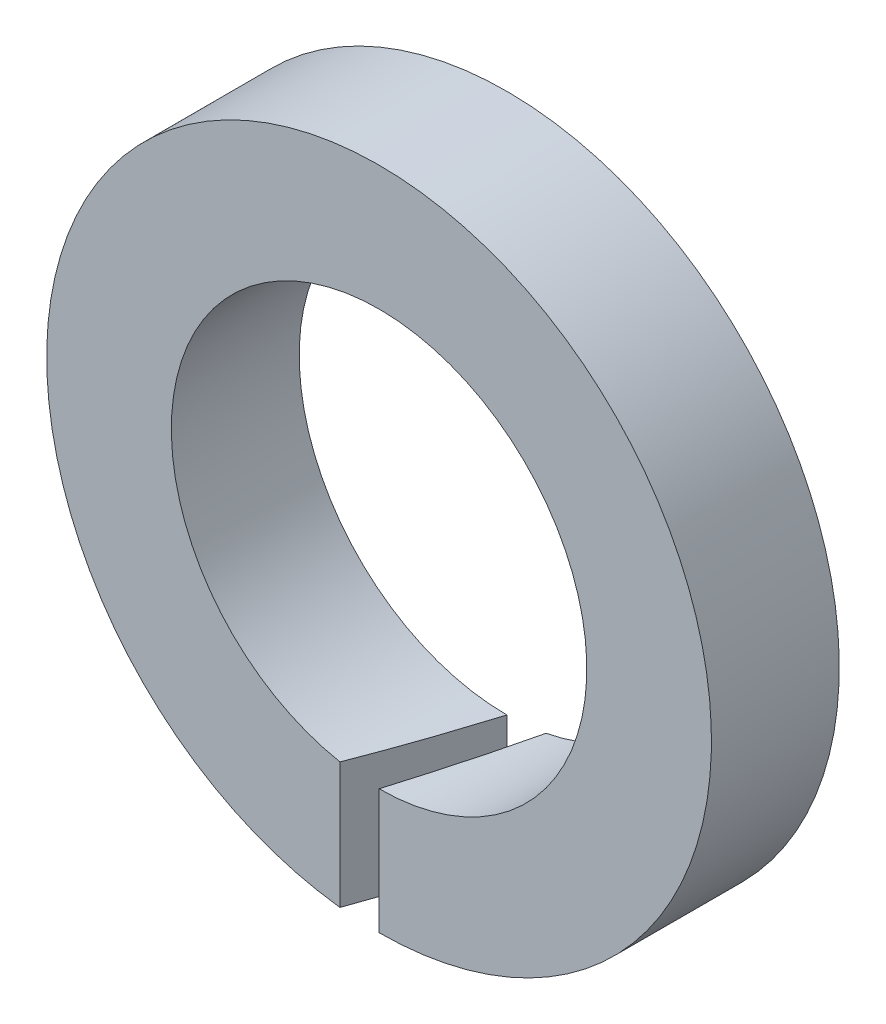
ISO-10303-21;
HEADER;
FILE_DESCRIPTION(('STEP AP214'),'2;1');
FILE_NAME('part.step','',(''),(''),'','','');
FILE_SCHEMA(('AUTOMOTIVE_DESIGN { 1 0 10303 214 1 1 1 1 }'));
ENDSEC;
DATA;
#1=APPLICATION_CONTEXT('core data for automotive mechanical design processes');
#2=APPLICATION_PROTOCOL_DEFINITION('international standard','automotive_design',2000,#1);
#3=PRODUCT_CONTEXT('',#1,'mechanical');
#4=PRODUCT('Part','Part','',(#3));
#5=PRODUCT_RELATED_PRODUCT_CATEGORY('part','',(#4));
#6=PRODUCT_DEFINITION_FORMATION('','',#4);
#7=PRODUCT_DEFINITION_CONTEXT('part definition',#1,'design');
#8=PRODUCT_DEFINITION('design','',#6,#7);
#9=PRODUCT_DEFINITION_SHAPE('','',#8);
#10=(LENGTH_UNIT() NAMED_UNIT(*) SI_UNIT(.MILLI.,.METRE.));
#11=(NAMED_UNIT(*) PLANE_ANGLE_UNIT() SI_UNIT($,.RADIAN.));
#12=(NAMED_UNIT(*) SI_UNIT($,.STERADIAN.) SOLID_ANGLE_UNIT());
#13=UNCERTAINTY_MEASURE_WITH_UNIT(LENGTH_MEASURE(1.E-05),#10,'distance_accuracy_value','');
#14=(GEOMETRIC_REPRESENTATION_CONTEXT(3) GLOBAL_UNCERTAINTY_ASSIGNED_CONTEXT((#13)) GLOBAL_UNIT_ASSIGNED_CONTEXT((#10,
#11,#12)) REPRESENTATION_CONTEXT('',''));
#15=CARTESIAN_POINT('',(0.,0.,0.));
#16=DIRECTION('',(0.,0.,1.));
#17=DIRECTION('',(1.,0.,0.));
#18=AXIS2_PLACEMENT_3D('',#15,#16,#17);
#19=CARTESIAN_POINT('',(0.,0.,0.));
#20=DIRECTION('',(0.,0.,-1.));
#21=DIRECTION('',(0.,1.,0.));
#22=AXIS2_PLACEMENT_3D('',#19,#20,#21);
#23=CYLINDRICAL_SURFACE('',#22,3.25);
#24=CARTESIAN_POINT('',(0.,0.,2.));
#25=DIRECTION('',(0.,0.,-1.));
#26=DIRECTION('',(0.,1.,0.));
#27=AXIS2_PLACEMENT_3D('',#24,#25,#26);
#28=CIRCLE('',#27,3.25);
#29=CARTESIAN_POINT('',(-0.611764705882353,-3.19190287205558,2.));
#30=VERTEX_POINT('',#29);
#31=CARTESIAN_POINT('',(0.,-3.25,2.));
#32=VERTEX_POINT('',#31);
#33=EDGE_CURVE('E11',#30,#32,#28,.T.);
#34=ORIENTED_EDGE('',*,*,#33,.F.);
#35=CARTESIAN_POINT('',(0.,0.,0.));
#36=DIRECTION('',(-0.956264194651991,0.,-0.29250434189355));
#37=DIRECTION('',(0.292504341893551,0.,-0.956264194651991));
#38=AXIS2_PLACEMENT_3D('',#35,#36,#37);
#39=ELLIPSE('',#38,11.1109461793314,3.25);
#40=CARTESIAN_POINT('',(0.,-3.25,0.));
#41=VERTEX_POINT('',#40);
#42=EDGE_CURVE('E79',#30,#41,#39,.F.);
#43=ORIENTED_EDGE('',*,*,#42,.T.);
#44=CARTESIAN_POINT('',(0.,0.,0.));
#45=DIRECTION('',(0.,0.,-1.));
#46=DIRECTION('',(0.,1.,0.));
#47=AXIS2_PLACEMENT_3D('',#44,#45,#46);
#48=CIRCLE('',#47,3.25);
#49=CARTESIAN_POINT('',(0.611764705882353,-3.19190287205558,0.));
#50=VERTEX_POINT('',#49);
#51=EDGE_CURVE('E74',#41,#50,#48,.T.);
#52=ORIENTED_EDGE('',*,*,#51,.T.);
#53=CARTESIAN_POINT('',(0.,0.,2.));
#54=DIRECTION('',(-0.956264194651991,0.,-0.29250434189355));
#55=DIRECTION('',(0.292504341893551,0.,-0.956264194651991));
#56=AXIS2_PLACEMENT_3D('',#53,#54,#55);
#57=ELLIPSE('',#56,11.1109461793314,3.25);
#58=EDGE_CURVE('E31',#32,#50,#57,.F.);
#59=ORIENTED_EDGE('',*,*,#58,.F.);
#60=EDGE_LOOP('',(#34,#43,#52,#59));
#61=FACE_BOUND('',#60,.T.);
#62=ADVANCED_FACE('F17',(#61),#23,.F.);
#63=CARTESIAN_POINT('',(5.2,0.,2.));
#64=DIRECTION('',(0.,0.,1.));
#65=DIRECTION('',(0.,-1.,0.));
#66=AXIS2_PLACEMENT_3D('',#63,#64,#65);
#67=PLANE('',#66);
#68=DIRECTION('',(0.,1.,0.));
#69=VECTOR('',#68,1.);
#70=CARTESIAN_POINT('',(-0.611764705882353,-5.395,2.));
#71=LINE('',#70,#69);
#72=CARTESIAN_POINT('',(-0.611764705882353,-5.16388845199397,2.));
#73=VERTEX_POINT('',#72);
#74=EDGE_CURVE('E64',#73,#30,#71,.T.);
#75=ORIENTED_EDGE('',*,*,#74,.T.);
#76=ORIENTED_EDGE('',*,*,#33,.T.);
#77=DIRECTION('',(0.,1.,0.));
#78=VECTOR('',#77,1.);
#79=CARTESIAN_POINT('',(0.,-5.395,2.));
#80=LINE('',#79,#78);
#81=CARTESIAN_POINT('',(0.,-5.2,2.));
#82=VERTEX_POINT('',#81);
#83=EDGE_CURVE('E58',#82,#32,#80,.T.);
#84=ORIENTED_EDGE('',*,*,#83,.F.);
#85=CARTESIAN_POINT('',(0.,0.,2.));
#86=DIRECTION('',(0.,0.,-1.));
#87=DIRECTION('',(0.,1.,0.));
#88=AXIS2_PLACEMENT_3D('',#85,#86,#87);
#89=CIRCLE('',#88,5.2);
#90=EDGE_CURVE('E24',#73,#82,#89,.T.);
#91=ORIENTED_EDGE('',*,*,#90,.F.);
#92=EDGE_LOOP('',(#75,#76,#84,#91));
#93=FACE_BOUND('',#92,.T.);
#94=ADVANCED_FACE('F69',(#93),#67,.T.);
#95=CARTESIAN_POINT('',(0.,0.,0.));
#96=DIRECTION('',(0.,0.,-1.));
#97=DIRECTION('',(0.,1.,0.));
#98=AXIS2_PLACEMENT_3D('',#95,#96,#97);
#99=CYLINDRICAL_SURFACE('',#98,5.2);
#100=CARTESIAN_POINT('',(0.,0.,0.));
#101=DIRECTION('',(-0.956264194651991,0.,-0.29250434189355));
#102=DIRECTION('',(0.292504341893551,0.,-0.956264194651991));
#103=AXIS2_PLACEMENT_3D('',#100,#101,#102);
#104=ELLIPSE('',#103,17.7775138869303,5.2);
#105=CARTESIAN_POINT('',(0.,-5.2,0.));
#106=VERTEX_POINT('',#105);
#107=EDGE_CURVE('E39',#73,#106,#104,.F.);
#108=ORIENTED_EDGE('',*,*,#107,.F.);
#109=ORIENTED_EDGE('',*,*,#90,.T.);
#110=CARTESIAN_POINT('',(0.,0.,2.));
#111=DIRECTION('',(-0.956264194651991,0.,-0.29250434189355));
#112=DIRECTION('',(0.292504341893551,0.,-0.956264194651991));
#113=AXIS2_PLACEMENT_3D('',#110,#111,#112);
#114=ELLIPSE('',#113,17.7775138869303,5.2);
#115=CARTESIAN_POINT('',(0.611764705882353,-5.16388845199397,0.));
#116=VERTEX_POINT('',#115);
#117=EDGE_CURVE('E55',#82,#116,#114,.F.);
#118=ORIENTED_EDGE('',*,*,#117,.T.);
#119=CARTESIAN_POINT('',(0.,0.,0.));
#120=DIRECTION('',(0.,0.,-1.));
#121=DIRECTION('',(0.,1.,0.));
#122=AXIS2_PLACEMENT_3D('',#119,#120,#121);
#123=CIRCLE('',#122,5.2);
#124=EDGE_CURVE('E73',#106,#116,#123,.T.);
#125=ORIENTED_EDGE('',*,*,#124,.F.);
#126=EDGE_LOOP('',(#108,#109,#118,#125));
#127=FACE_BOUND('',#126,.T.);
#128=ADVANCED_FACE('F72',(#127),#99,.T.);
#129=CARTESIAN_POINT('',(3.25,0.,0.));
#130=DIRECTION('',(0.,0.,-1.));
#131=DIRECTION('',(0.,1.,0.));
#132=AXIS2_PLACEMENT_3D('',#129,#130,#131);
#133=PLANE('',#132);
#134=DIRECTION('',(0.,1.,0.));
#135=VECTOR('',#134,1.);
#136=CARTESIAN_POINT('',(0.,-5.395,0.));
#137=LINE('',#136,#135);
#138=EDGE_CURVE('E84',#106,#41,#137,.T.);
#139=ORIENTED_EDGE('',*,*,#138,.F.);
#140=ORIENTED_EDGE('',*,*,#124,.T.);
#141=DIRECTION('',(0.,1.,0.));
#142=VECTOR('',#141,1.);
#143=CARTESIAN_POINT('',(0.611764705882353,-5.395,0.));
#144=LINE('',#143,#142);
#145=EDGE_CURVE('E59',#116,#50,#144,.T.);
#146=ORIENTED_EDGE('',*,*,#145,.T.);
#147=ORIENTED_EDGE('',*,*,#51,.F.);
#148=EDGE_LOOP('',(#139,#140,#146,#147));
#149=FACE_BOUND('',#148,.T.);
#150=ADVANCED_FACE('F90',(#149),#133,.T.);
#151=CARTESIAN_POINT('',(0.611764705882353,-5.395,0.));
#152=DIRECTION('',(-0.956264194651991,0.,-0.29250434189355));
#153=DIRECTION('',(0.292504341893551,0.,-0.956264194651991));
#154=AXIS2_PLACEMENT_3D('',#151,#152,#153);
#155=PLANE('',#154);
#156=ORIENTED_EDGE('',*,*,#58,.T.);
#157=ORIENTED_EDGE('',*,*,#145,.F.);
#158=ORIENTED_EDGE('',*,*,#117,.F.);
#159=ORIENTED_EDGE('',*,*,#83,.T.);
#160=EDGE_LOOP('',(#156,#157,#158,#159));
#161=FACE_BOUND('',#160,.T.);
#162=ADVANCED_FACE('F57',(#161),#155,.T.);
#163=CARTESIAN_POINT('',(0.,-5.395,0.));
#164=DIRECTION('',(-0.956264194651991,0.,-0.29250434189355));
#165=DIRECTION('',(0.292504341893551,0.,-0.956264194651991));
#166=AXIS2_PLACEMENT_3D('',#163,#164,#165);
#167=PLANE('',#166);
#168=ORIENTED_EDGE('',*,*,#74,.F.);
#169=ORIENTED_EDGE('',*,*,#107,.T.);
#170=ORIENTED_EDGE('',*,*,#138,.T.);
#171=ORIENTED_EDGE('',*,*,#42,.F.);
#172=EDGE_LOOP('',(#168,#169,#170,#171));
#173=FACE_BOUND('',#172,.T.);
#174=ADVANCED_FACE('F91',(#173),#167,.F.);
#175=CLOSED_SHELL('',(#62,#94,#128,#150,#162,#174));
#176=MANIFOLD_SOLID_BREP('B1',#175);
#177=ADVANCED_BREP_SHAPE_REPRESENTATION('',(#18,#176),#14);
#178=SHAPE_DEFINITION_REPRESENTATION(#9,#177);
ENDSEC;
END-ISO-10303-21;
